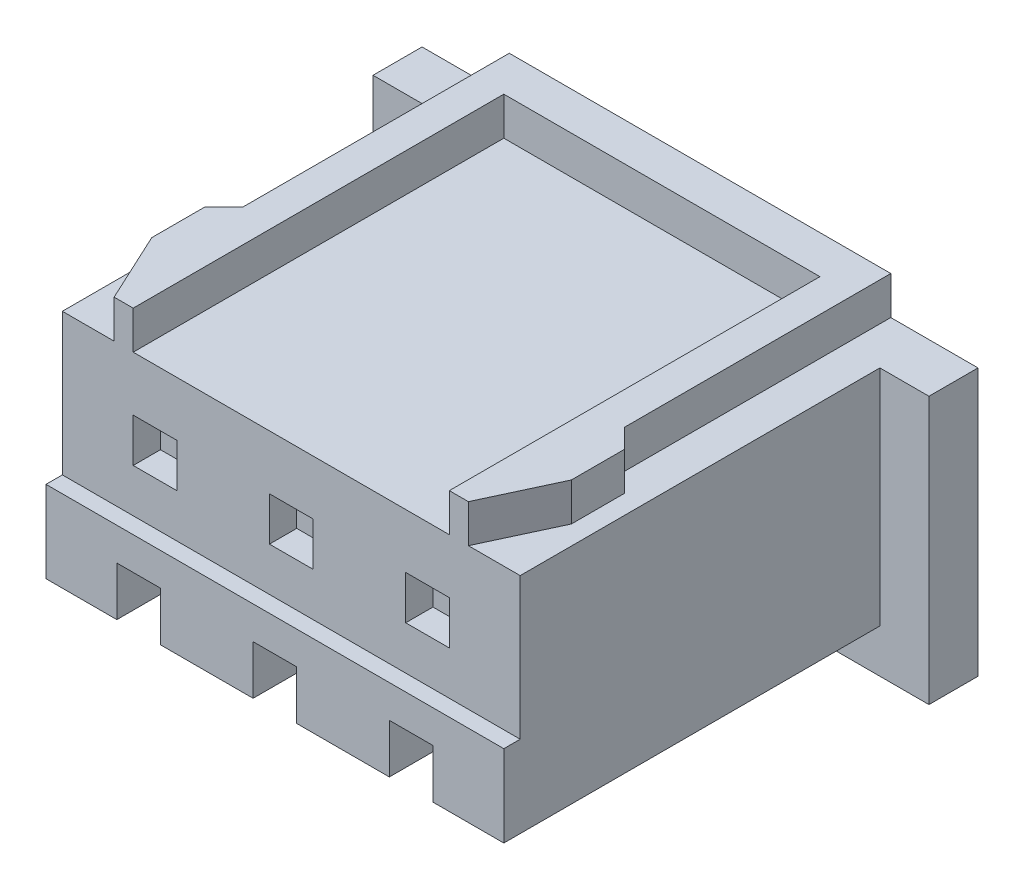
from build123d import *

# Parameters (mm, degrees)
ESQUISSE1_W             = 10.2
ESQUISSE1_H             = 5.6
BOSS_EXTRU_1_DEPTH      = 7.8
ESQUISSE2_W             = 10.2
ESQUISSE2_H             = 3.3
ENL_V_MAT_EXTRU_1_DEPTH = 0.3
ESQUISSE4_W             = 0.9
ESQUISSE4_H             = 3.3
ENL_V_MAT_EXTRU_2_DEPTH = 6.9
ESQUISSE5_W             = 2.9
ESQUISSE5_H             = 6.8
ENL_V_MAT_EXTRU_3_DEPTH = 0.7
ESQUISSE6_W             = 0.8
ESQUISSE6_H             = 0.9
ENL_V_MAT_EXTRU_4_DEPTH = 0.8
ESQUISSE7_W             = 0.8
ESQUISSE7_H             = 0.8
ENL_V_MAT_EXTRU_5_DEPTH = 0.5
ENL_V_MAT_EXTRU_6_DEPTH = 7
ENL_V_MAT_EXTRU_7_DEPTH = 0.8
ESQUISSE10_R            = 0.6
ENL_V_MAT_EXTRU_8_DEPTH = 0.5
ESQUISSE11_W            = 0.8
ESQUISSE11_H            = 0.3
ENL_V_MAT_EXTRU_9_DEPTH = 2.2


with BuildPart() as part:
    # Esquisse1 → Boss.-Extru.1 (new body)
    with BuildSketch(Plane.XY):
        Rectangle(ESQUISSE1_W, ESQUISSE1_H)
    extrude(amount=-BOSS_EXTRU_1_DEPTH)

    # Esquisse2 → Enl_v. mat.-Extru.1 (cut)
    with BuildSketch(Plane.XY):
        with Locations((0, 1.15)):
            Rectangle(ESQUISSE2_W, ESQUISSE2_H)
    extrude(amount=-ENL_V_MAT_EXTRU_1_DEPTH, mode=Mode.SUBTRACT)

    # Esquisse4 → Enl_v. mat.-Extru.2 (cut)
    with BuildSketch(Plane.XY):
        with Locations((-4.65, 1.15)):
            Rectangle(ESQUISSE4_W, ESQUISSE4_H)
        Polygon((5.1, -2.8), (5.1, -0.5), (4.2, -0.5), (4.2, -2), (-4.2, -2), (-4.2, -0.5), (-5.1, -0.5), (-5.1, -2.8), align=None)
        with Locations((4.65, 1.15)):
            Rectangle(ESQUISSE4_W, ESQUISSE4_H)
    extrude(amount=-ENL_V_MAT_EXTRU_2_DEPTH, mode=Mode.SUBTRACT)

    # Esquisse5 → Enl_v. mat.-Extru.3 (cut)
    with BuildSketch(Plane(origin=(0, 2.8, 0), x_dir=(1, 0, 0), z_dir=(0, 1, 0))):
        with Locations((-1.45, 3.7)):
            Rectangle(ESQUISSE5_W, ESQUISSE5_H)
        with Locations((1.45, 3.7)):
            Rectangle(ESQUISSE5_W, ESQUISSE5_H)
        Polygon((5.1, 7.8), (3.5, 7.8), (3.5, 2.91), (3.85, 2.56), (3.85, 1.59), (3.25, 0.3), (4.2, 0.3), (4.2, 6.9), (5.1, 6.9), align=None)
        Polygon((-3.5, 2.91), (-3.5, 7.8), (-5.1, 7.8), (-5.1, 6.9), (-4.2, 6.9), (-4.2, 0.3), (-3.25, 0.3), (-3.85, 1.59), (-3.85, 2.56), align=None)
    extrude(amount=-ENL_V_MAT_EXTRU_3_DEPTH, mode=Mode.SUBTRACT)

    # Esquisse6 → Enl_v. mat.-Extru.4 (cut)
    with BuildSketch(Plane.XY):
        with Locations((-2.5, -1.55)):
            Rectangle(ESQUISSE6_W, ESQUISSE6_H)
        with Locations((0, -1.55)):
            Rectangle(ESQUISSE6_W, ESQUISSE6_H)
        with Locations((2.5, -1.55)):
            Rectangle(ESQUISSE6_W, ESQUISSE6_H)
    extrude(amount=-ENL_V_MAT_EXTRU_4_DEPTH, mode=Mode.SUBTRACT)

    # Esquisse7 → Enl_v. mat.-Extru.5 (cut)
    with BuildSketch(Plane.XY.offset(-0.3)):
        with Locations((-2.5, 0.7)):
            Rectangle(ESQUISSE7_W, ESQUISSE7_H)
        with Locations((0, 0.7)):
            Rectangle(ESQUISSE7_W, ESQUISSE7_H)
        with Locations((2.5, 0.7)):
            Rectangle(ESQUISSE7_W, ESQUISSE7_H)
    extrude(amount=-ENL_V_MAT_EXTRU_5_DEPTH, mode=Mode.SUBTRACT)

    # Esquisse8 → Enl_v. mat.-Extru.6 (cut)
    # profile 1 of 3: a face of its own
    with BuildSketch(Plane(origin=(0, 0, -7.8), x_dir=(-1, 0, 0), z_dir=(0, 0, -1))):
        Polygon((0.4, -1.5), (0.8, -1.5), (0.8, 1.5), (-0.8, 1.5), (-0.8, -1.5), (-0.4, -1.5), (-0.4, -1.7), (0.4, -1.7), align=None)
        with BuildLine():
            ThreePointArc((-0.7, 0.95), (-0.35, 1.3), (0, 0.95))
            ThreePointArc((0, 0.95), (0.35, 1.3), (0.7, 0.95))
            Line((0.7, 0.95), (0.7, -1.45))
            Line((0.7, -1.45), (-0.7, -1.45))
            Line((-0.7, -1.45), (-0.7, 0.95))
        make_face(mode=Mode.SUBTRACT)
    # profile 2 of 3: a face of its own
    with BuildSketch(Plane(origin=(0, 0, -7.8), x_dir=(-1, 0, 0), z_dir=(0, 0, -1))):
        Polygon((-2.1, -1.5), (-1.7, -1.5), (-1.7, 1.5), (-3.3, 1.5), (-3.3, -1.5), (-2.9, -1.5), (-2.9, -1.7), (-2.1, -1.7), align=None)
        with BuildLine():
            ThreePointArc((-3.2, 0.95), (-2.85, 1.3), (-2.5, 0.95))
            ThreePointArc((-2.5, 0.95), (-2.15, 1.3), (-1.8, 0.95))
            Line((-1.8, 0.95), (-1.8, -1.45))
            Line((-1.8, -1.45), (-3.2, -1.45))
            Line((-3.2, -1.45), (-3.2, 0.95))
        make_face(mode=Mode.SUBTRACT)
    # profile 3 of 3: a face of its own
    with BuildSketch(Plane(origin=(0, 0, -7.8), x_dir=(-1, 0, 0), z_dir=(0, 0, -1))):
        Polygon((2.9, -1.5), (3.3, -1.5), (3.3, 1.5), (1.7, 1.5), (1.7, -1.5), (2.1, -1.5), (2.1, -1.7), (2.9, -1.7), align=None)
        with BuildLine():
            ThreePointArc((1.8, 0.95), (2.15, 1.3), (2.5, 0.95))
            ThreePointArc((2.5, 0.95), (2.85, 1.3), (3.2, 0.95))
            Line((3.2, 0.95), (3.2, -1.45))
            Line((3.2, -1.45), (1.8, -1.45))
            Line((1.8, -1.45), (1.8, 0.95))
        make_face(mode=Mode.SUBTRACT)
    extrude(amount=-ENL_V_MAT_EXTRU_6_DEPTH, mode=Mode.SUBTRACT)

    # Esquisse9 → Enl_v. mat.-Extru.7 (cut)
    with BuildSketch(Plane(origin=(0, 0, -7.8), x_dir=(-1, 0, 0), z_dir=(0, 0, -1))):
        with BuildLine():
            Line((-0.7, 0.95), (-0.7, -1.45))
            Line((-0.7, -1.45), (0.7, -1.45))
            Line((0.7, -1.45), (0.7, 0.95))
            ThreePointArc((0.7, 0.95), (0.35, 1.3), (0, 0.95))
            ThreePointArc((0, 0.95), (-0.35, 1.3), (-0.7, 0.95))
        make_face()
        with BuildLine():
            Line((-3.2, 0.95), (-3.2, -1.45))
            Line((-3.2, -1.45), (-1.8, -1.45))
            Line((-1.8, -1.45), (-1.8, 0.95))
            ThreePointArc((-1.8, 0.95), (-2.15, 1.3), (-2.5, 0.95))
            ThreePointArc((-2.5, 0.95), (-2.85, 1.3), (-3.2, 0.95))
        make_face()
        with BuildLine():
            Line((1.8, 0.95), (1.8, -1.45))
            Line((1.8, -1.45), (3.2, -1.45))
            Line((3.2, -1.45), (3.2, 0.95))
            ThreePointArc((3.2, 0.95), (2.85, 1.3), (2.5, 0.95))
            ThreePointArc((2.5, 0.95), (2.15, 1.3), (1.8, 0.95))
        make_face()
    extrude(amount=-ENL_V_MAT_EXTRU_7_DEPTH, mode=Mode.SUBTRACT)

    # Esquisse10 → Enl_v. mat.-Extru.8 (cut)
    with BuildSketch(Plane(origin=(0, 0, -7), x_dir=(-1, 0, 0), z_dir=(0, 0, -1))):
        Circle(ESQUISSE10_R)
        with Locations((-2.5, 0)):
            Circle(ESQUISSE10_R)
        with Locations((2.5, 0)):
            Circle(ESQUISSE10_R)
    extrude(amount=-ENL_V_MAT_EXTRU_8_DEPTH, mode=Mode.SUBTRACT)

    # Esquisse11 → Enl_v. mat.-Extru.9 (cut)
    with BuildSketch(Plane.XY.offset(-0.8)):
        with Locations((-2.5, -1.85)):
            Rectangle(ESQUISSE11_W, ESQUISSE11_H)
        with Locations((0, -1.85)):
            Rectangle(ESQUISSE11_W, ESQUISSE11_H)
        with Locations((2.5, -1.85)):
            Rectangle(ESQUISSE11_W, ESQUISSE11_H)
    extrude(amount=-ENL_V_MAT_EXTRU_9_DEPTH, mode=Mode.SUBTRACT)


solid = part.part
